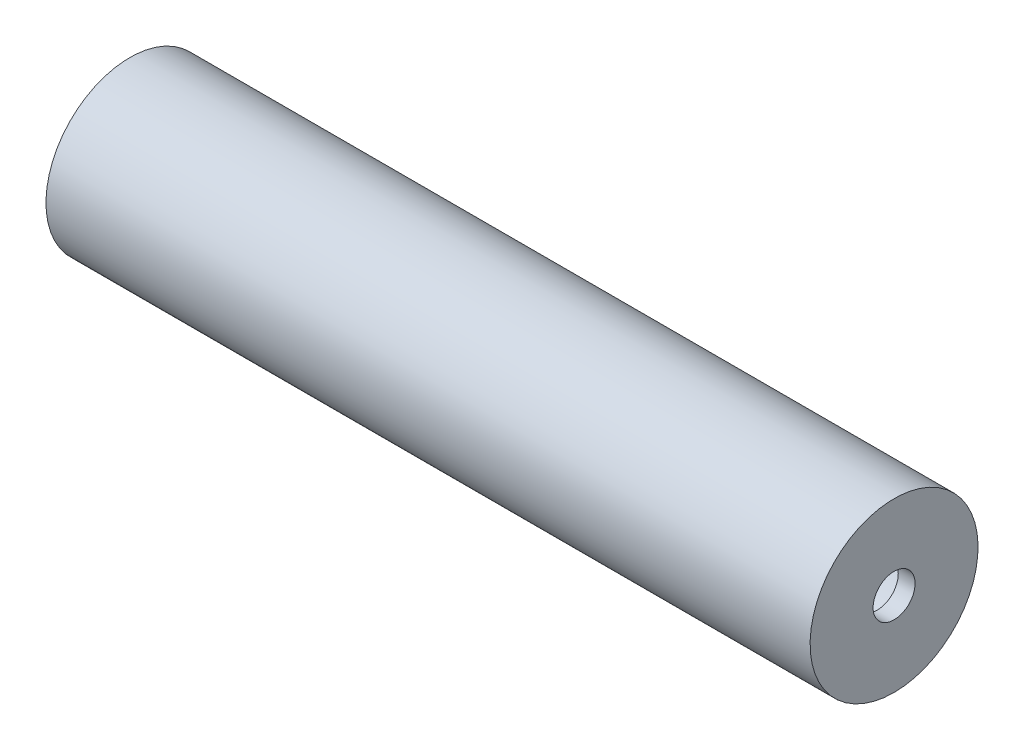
ISO-10303-21;
HEADER;
FILE_DESCRIPTION(('STEP AP214'),'2;1');
FILE_NAME('part.step','',(''),(''),'','','');
FILE_SCHEMA(('AUTOMOTIVE_DESIGN { 1 0 10303 214 1 1 1 1 }'));
ENDSEC;
DATA;
#1=APPLICATION_CONTEXT('core data for automotive mechanical design processes');
#2=APPLICATION_PROTOCOL_DEFINITION('international standard','automotive_design',2000,#1);
#3=PRODUCT_CONTEXT('',#1,'mechanical');
#4=PRODUCT('Part','Part','',(#3));
#5=PRODUCT_RELATED_PRODUCT_CATEGORY('part','',(#4));
#6=PRODUCT_DEFINITION_FORMATION('','',#4);
#7=PRODUCT_DEFINITION_CONTEXT('part definition',#1,'design');
#8=PRODUCT_DEFINITION('design','',#6,#7);
#9=PRODUCT_DEFINITION_SHAPE('','',#8);
#10=(LENGTH_UNIT() NAMED_UNIT(*) SI_UNIT(.MILLI.,.METRE.));
#11=(NAMED_UNIT(*) PLANE_ANGLE_UNIT() SI_UNIT($,.RADIAN.));
#12=(NAMED_UNIT(*) SI_UNIT($,.STERADIAN.) SOLID_ANGLE_UNIT());
#13=UNCERTAINTY_MEASURE_WITH_UNIT(LENGTH_MEASURE(1.E-05),#10,'distance_accuracy_value','');
#14=(GEOMETRIC_REPRESENTATION_CONTEXT(3) GLOBAL_UNCERTAINTY_ASSIGNED_CONTEXT((#13)) GLOBAL_UNIT_ASSIGNED_CONTEXT((#10,
#11,#12)) REPRESENTATION_CONTEXT('',''));
#15=CARTESIAN_POINT('',(0.,0.,0.));
#16=DIRECTION('',(0.,0.,1.));
#17=DIRECTION('',(1.,0.,0.));
#18=AXIS2_PLACEMENT_3D('',#15,#16,#17);
#19=CARTESIAN_POINT('',(-45.5,0.,0.));
#20=DIRECTION('',(-1.,0.,0.));
#21=DIRECTION('',(0.,-1.,0.));
#22=AXIS2_PLACEMENT_3D('',#19,#20,#21);
#23=CYLINDRICAL_SURFACE('',#22,10.);
#24=CARTESIAN_POINT('',(-45.5,0.,0.));
#25=DIRECTION('',(-1.,0.,0.));
#26=DIRECTION('',(0.,-1.,0.));
#27=AXIS2_PLACEMENT_3D('',#24,#25,#26);
#28=CIRCLE('',#27,10.);
#29=CARTESIAN_POINT('',(-45.5,-10.,0.));
#30=VERTEX_POINT('',#29);
#31=EDGE_CURVE('E65',#30,#30,#28,.T.);
#32=ORIENTED_EDGE('',*,*,#31,.F.);
#33=EDGE_LOOP('',(#32));
#34=FACE_BOUND('',#33,.T.);
#35=CARTESIAN_POINT('',(45.5,0.,0.));
#36=DIRECTION('',(-1.,0.,0.));
#37=DIRECTION('',(0.,-1.,0.));
#38=AXIS2_PLACEMENT_3D('',#35,#36,#37);
#39=CIRCLE('',#38,10.);
#40=CARTESIAN_POINT('',(45.5,-9.99999999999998,0.));
#41=VERTEX_POINT('',#40);
#42=EDGE_CURVE('E10',#41,#41,#39,.T.);
#43=ORIENTED_EDGE('',*,*,#42,.T.);
#44=EDGE_LOOP('',(#43));
#45=FACE_BOUND('',#44,.T.);
#46=ADVANCED_FACE('F37',(#34,#45),#23,.T.);
#47=CARTESIAN_POINT('',(45.5,10.,0.));
#48=DIRECTION('',(-1.,0.,0.));
#49=DIRECTION('',(0.,-1.,0.));
#50=AXIS2_PLACEMENT_3D('',#47,#48,#49);
#51=PLANE('',#50);
#52=ORIENTED_EDGE('',*,*,#42,.F.);
#53=EDGE_LOOP('',(#52));
#54=FACE_BOUND('',#53,.T.);
#55=CARTESIAN_POINT('',(45.5,0.,0.));
#56=DIRECTION('',(-1.,0.,0.));
#57=DIRECTION('',(0.,-1.,0.));
#58=AXIS2_PLACEMENT_3D('',#55,#56,#57);
#59=CIRCLE('',#58,2.5);
#60=CARTESIAN_POINT('',(45.5,-2.49999999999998,0.));
#61=VERTEX_POINT('',#60);
#62=EDGE_CURVE('E43',#61,#61,#59,.T.);
#63=ORIENTED_EDGE('',*,*,#62,.T.);
#64=EDGE_LOOP('',(#63));
#65=FACE_BOUND('',#64,.T.);
#66=ADVANCED_FACE('F72',(#54,#65),#51,.F.);
#67=CARTESIAN_POINT('',(-45.5,0.,0.));
#68=DIRECTION('',(-1.,0.,0.));
#69=DIRECTION('',(0.,-1.,0.));
#70=AXIS2_PLACEMENT_3D('',#67,#68,#69);
#71=CYLINDRICAL_SURFACE('',#70,2.5);
#72=ORIENTED_EDGE('',*,*,#62,.F.);
#73=EDGE_LOOP('',(#72));
#74=FACE_BOUND('',#73,.T.);
#75=CARTESIAN_POINT('',(43.5,0.,0.));
#76=DIRECTION('',(-1.,0.,0.));
#77=DIRECTION('',(0.,-1.,0.));
#78=AXIS2_PLACEMENT_3D('',#75,#76,#77);
#79=CIRCLE('',#78,2.5);
#80=CARTESIAN_POINT('',(43.5,-2.49999999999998,0.));
#81=VERTEX_POINT('',#80);
#82=EDGE_CURVE('E47',#81,#81,#79,.T.);
#83=ORIENTED_EDGE('',*,*,#82,.T.);
#84=EDGE_LOOP('',(#83));
#85=FACE_BOUND('',#84,.T.);
#86=ADVANCED_FACE('F76',(#74,#85),#71,.F.);
#87=CARTESIAN_POINT('',(43.5,8.,0.));
#88=DIRECTION('',(1.,0.,0.));
#89=DIRECTION('',(0.,1.,0.));
#90=AXIS2_PLACEMENT_3D('',#87,#88,#89);
#91=PLANE('',#90);
#92=ORIENTED_EDGE('',*,*,#82,.F.);
#93=EDGE_LOOP('',(#92));
#94=FACE_BOUND('',#93,.T.);
#95=CARTESIAN_POINT('',(43.5,0.,0.));
#96=DIRECTION('',(-1.,0.,0.));
#97=DIRECTION('',(0.,-1.,0.));
#98=AXIS2_PLACEMENT_3D('',#95,#96,#97);
#99=CIRCLE('',#98,7.99999999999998);
#100=CARTESIAN_POINT('',(43.5,-7.99999999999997,0.));
#101=VERTEX_POINT('',#100);
#102=EDGE_CURVE('E51',#101,#101,#99,.T.);
#103=ORIENTED_EDGE('',*,*,#102,.T.);
#104=EDGE_LOOP('',(#103));
#105=FACE_BOUND('',#104,.T.);
#106=ADVANCED_FACE('F81',(#94,#105),#91,.F.);
#107=CARTESIAN_POINT('',(-45.5,0.,0.));
#108=DIRECTION('',(-1.,0.,0.));
#109=DIRECTION('',(0.,-1.,0.));
#110=AXIS2_PLACEMENT_3D('',#107,#108,#109);
#111=CYLINDRICAL_SURFACE('',#110,7.99999999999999);
#112=ORIENTED_EDGE('',*,*,#102,.F.);
#113=EDGE_LOOP('',(#112));
#114=FACE_BOUND('',#113,.T.);
#115=CARTESIAN_POINT('',(-43.5,0.,0.));
#116=DIRECTION('',(-1.,0.,0.));
#117=DIRECTION('',(0.,-1.,0.));
#118=AXIS2_PLACEMENT_3D('',#115,#116,#117);
#119=CIRCLE('',#118,8.);
#120=CARTESIAN_POINT('',(-43.5,-8.,0.));
#121=VERTEX_POINT('',#120);
#122=EDGE_CURVE('E56',#121,#121,#119,.T.);
#123=ORIENTED_EDGE('',*,*,#122,.T.);
#124=EDGE_LOOP('',(#123));
#125=FACE_BOUND('',#124,.T.);
#126=ADVANCED_FACE('F87',(#114,#125),#111,.F.);
#127=CARTESIAN_POINT('',(-43.5,2.5,0.));
#128=DIRECTION('',(-1.,0.,0.));
#129=DIRECTION('',(0.,-1.,0.));
#130=AXIS2_PLACEMENT_3D('',#127,#128,#129);
#131=PLANE('',#130);
#132=ORIENTED_EDGE('',*,*,#122,.F.);
#133=EDGE_LOOP('',(#132));
#134=FACE_BOUND('',#133,.T.);
#135=CARTESIAN_POINT('',(-43.5,0.,0.));
#136=DIRECTION('',(-1.,0.,0.));
#137=DIRECTION('',(0.,-1.,0.));
#138=AXIS2_PLACEMENT_3D('',#135,#136,#137);
#139=CIRCLE('',#138,2.5);
#140=CARTESIAN_POINT('',(-43.5,-2.5,0.));
#141=VERTEX_POINT('',#140);
#142=EDGE_CURVE('E59',#141,#141,#139,.T.);
#143=ORIENTED_EDGE('',*,*,#142,.T.);
#144=EDGE_LOOP('',(#143));
#145=FACE_BOUND('',#144,.T.);
#146=ADVANCED_FACE('F91',(#134,#145),#131,.F.);
#147=CARTESIAN_POINT('',(-45.5,0.,0.));
#148=DIRECTION('',(-1.,0.,0.));
#149=DIRECTION('',(0.,-1.,0.));
#150=AXIS2_PLACEMENT_3D('',#147,#148,#149);
#151=CYLINDRICAL_SURFACE('',#150,2.5);
#152=ORIENTED_EDGE('',*,*,#142,.F.);
#153=EDGE_LOOP('',(#152));
#154=FACE_BOUND('',#153,.T.);
#155=CARTESIAN_POINT('',(-45.5,0.,0.));
#156=DIRECTION('',(-1.,0.,0.));
#157=DIRECTION('',(0.,-1.,0.));
#158=AXIS2_PLACEMENT_3D('',#155,#156,#157);
#159=CIRCLE('',#158,2.5);
#160=CARTESIAN_POINT('',(-45.5,-2.5,0.));
#161=VERTEX_POINT('',#160);
#162=EDGE_CURVE('E62',#161,#161,#159,.T.);
#163=ORIENTED_EDGE('',*,*,#162,.T.);
#164=EDGE_LOOP('',(#163));
#165=FACE_BOUND('',#164,.T.);
#166=ADVANCED_FACE('F95',(#154,#165),#151,.F.);
#167=CARTESIAN_POINT('',(-45.5,2.5,0.));
#168=DIRECTION('',(1.,0.,0.));
#169=DIRECTION('',(0.,1.,0.));
#170=AXIS2_PLACEMENT_3D('',#167,#168,#169);
#171=PLANE('',#170);
#172=ORIENTED_EDGE('',*,*,#162,.F.);
#173=EDGE_LOOP('',(#172));
#174=FACE_BOUND('',#173,.T.);
#175=ORIENTED_EDGE('',*,*,#31,.T.);
#176=EDGE_LOOP('',(#175));
#177=FACE_BOUND('',#176,.T.);
#178=ADVANCED_FACE('F69',(#174,#177),#171,.F.);
#179=CLOSED_SHELL('',(#46,#66,#86,#106,#126,#146,#166,#178));
#180=MANIFOLD_SOLID_BREP('B2',#179);
#181=ADVANCED_BREP_SHAPE_REPRESENTATION('',(#18,#180),#14);
#182=SHAPE_DEFINITION_REPRESENTATION(#9,#181);
ENDSEC;
END-ISO-10303-21;
